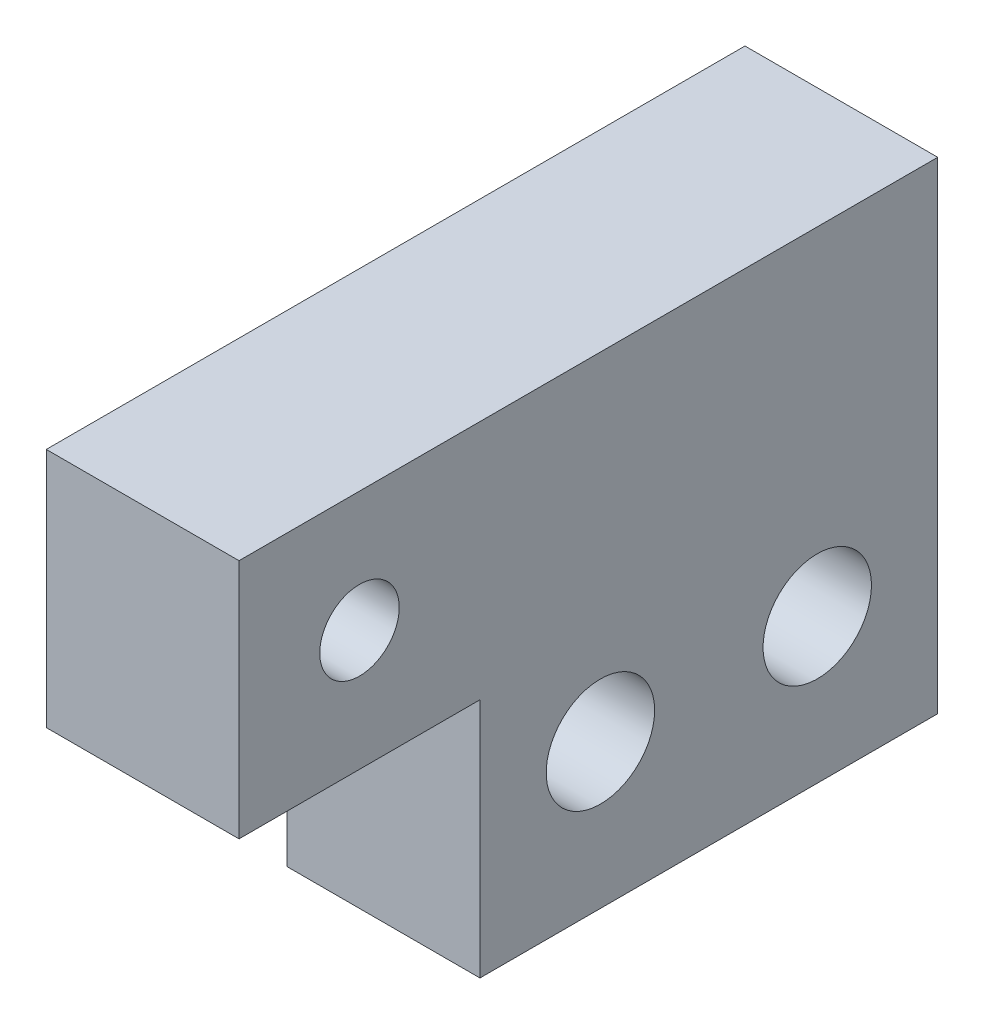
from build123d import *

# Parameters (mm, degrees)
SKETCH_1_W           = 8
SKETCH_1_H           = 20
EXTRUDE_1_DEPTH      = 29
SKETCH_2_OUTSIDE_W   = 38.224
SKETCH_2_OUTSIDE_H   = 29.224
SKETCH_2_OUTSIDE_R   = 2.25
SKETCH_2_OUTSIDE_R_2 = 1.65
CUT_EXTRUDE_1_DEPTH  = 29
SKETCH_4_R           = 4
CUT_EXTRUDE_2_DEPTH  = 4.5


with BuildPart() as part:
    # Sketch 1 → Extrude 1 (new body)
    with BuildSketch(Plane.XY):
        with Locations((4, 10)):
            Rectangle(SKETCH_1_W, SKETCH_1_H)
    extrude(amount=EXTRUDE_1_DEPTH)

    # Sketch 2 outside → Cut-Extrude 1 (cut)
    # profile 1 of 4: a face of its own
    with BuildSketch(Plane(origin=(8, 0, 0), x_dir=(0, 0, -1), z_dir=(1, 0, 0))):
        with Locations((-14.5, 10)):
            Rectangle(SKETCH_2_OUTSIDE_W, SKETCH_2_OUTSIDE_H)
        Polygon((-29, 20), (0, 20), (0, 0), (-19, 0), (-19, 10), (-29, 10), align=None, mode=Mode.SUBTRACT)
    # profile 2 of 4: a face of its own
    with BuildSketch(Plane(origin=(8, 0, 0), x_dir=(0, 0, -1), z_dir=(1, 0, 0))):
        with Locations((-14, 6)):
            Circle(SKETCH_2_OUTSIDE_R)
    # profile 3 of 4: a face of its own
    with BuildSketch(Plane(origin=(8, 0, 0), x_dir=(0, 0, -1), z_dir=(1, 0, 0))):
        with Locations((-5, 6)):
            Circle(SKETCH_2_OUTSIDE_R)
    # profile 4 of 4: a face of its own
    with BuildSketch(Plane(origin=(8, 0, 0), x_dir=(0, 0, -1), z_dir=(1, 0, 0))):
        with Locations((-24, 15)):
            Circle(SKETCH_2_OUTSIDE_R_2)
    extrude(amount=-CUT_EXTRUDE_1_DEPTH, mode=Mode.SUBTRACT)

    # Sketch 4 → Cut-Extrude 2 (cut)
    with BuildSketch(Plane.ZY):
        with Locations((5, 6)):
            Circle(SKETCH_4_R)
        with Locations((14, 6)):
            Circle(SKETCH_4_R)
    extrude(amount=-CUT_EXTRUDE_2_DEPTH, mode=Mode.SUBTRACT)


solid = part.part
